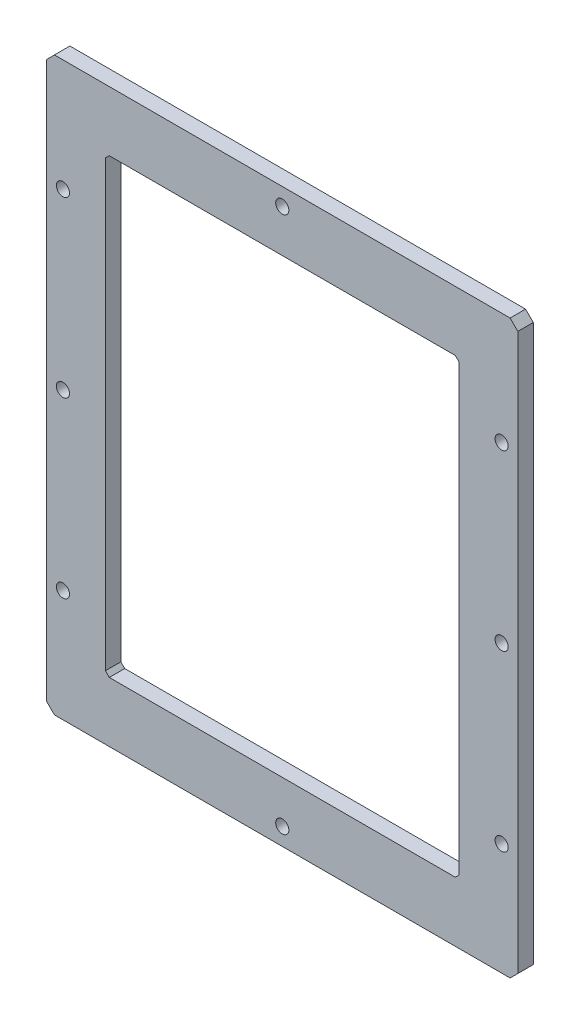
from build123d import *

# Parameters (mm, degrees)
SKETCH_1_R                                     = 1.7
FLAT_RING_8_CLEARANCE_HOLES_OUTSIDE_FILM_DEPTH = 4


with BuildPart() as part:
    # Sketch 1 → Flat_ring_8_clearance_holes_outside_film (new body)
    with BuildSketch(Plane.XY):
        Polygon((-59, -74), (59, -74), (61, -72), (61, 72), (59, 74), (-59, 74), (-61, 72), (-61, -72), align=None)
        with Locations((-56.8, -45)):
            Circle(SKETCH_1_R, mode=Mode.SUBTRACT)
        with Locations((-56.8, 0)):
            Circle(SKETCH_1_R, mode=Mode.SUBTRACT)
        with Locations((-56.8, 45)):
            Circle(SKETCH_1_R, mode=Mode.SUBTRACT)
        with Locations((56.8, -45)):
            Circle(SKETCH_1_R, mode=Mode.SUBTRACT)
        with Locations((56.8, 0)):
            Circle(SKETCH_1_R, mode=Mode.SUBTRACT)
        with Locations((56.8, 45)):
            Circle(SKETCH_1_R, mode=Mode.SUBTRACT)
        with Locations((0, -69.5)):
            Circle(SKETCH_1_R, mode=Mode.SUBTRACT)
        with Locations((0, 69.5)):
            Circle(SKETCH_1_R, mode=Mode.SUBTRACT)
        Polygon((-44.8, -58.5), (44.8, -58.5), (45.8, -57.5), (45.8, 57.5), (44.8, 58.5), (-44.8, 58.5), (-45.8, 57.5), (-45.8, -57.5), align=None, mode=Mode.SUBTRACT)
    extrude(amount=FLAT_RING_8_CLEARANCE_HOLES_OUTSIDE_FILM_DEPTH)


solid = part.part
